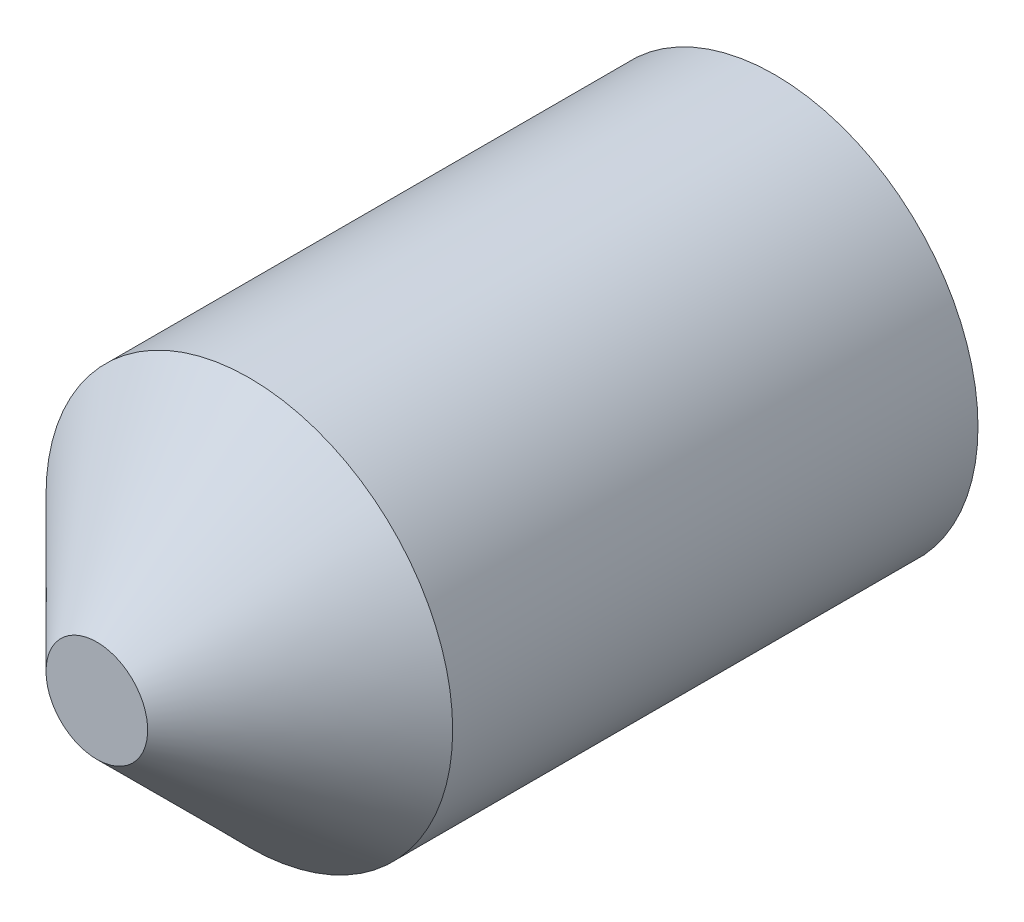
ISO-10303-21;
HEADER;
FILE_DESCRIPTION(('STEP AP214'),'2;1');
FILE_NAME('part.step','',(''),(''),'','','');
FILE_SCHEMA(('AUTOMOTIVE_DESIGN { 1 0 10303 214 1 1 1 1 }'));
ENDSEC;
DATA;
#1=APPLICATION_CONTEXT('core data for automotive mechanical design processes');
#2=APPLICATION_PROTOCOL_DEFINITION('international standard','automotive_design',2000,#1);
#3=PRODUCT_CONTEXT('',#1,'mechanical');
#4=PRODUCT('Part','Part','',(#3));
#5=PRODUCT_RELATED_PRODUCT_CATEGORY('part','',(#4));
#6=PRODUCT_DEFINITION_FORMATION('','',#4);
#7=PRODUCT_DEFINITION_CONTEXT('part definition',#1,'design');
#8=PRODUCT_DEFINITION('design','',#6,#7);
#9=PRODUCT_DEFINITION_SHAPE('','',#8);
#10=(LENGTH_UNIT() NAMED_UNIT(*) SI_UNIT(.MILLI.,.METRE.));
#11=(NAMED_UNIT(*) PLANE_ANGLE_UNIT() SI_UNIT($,.RADIAN.));
#12=(NAMED_UNIT(*) SI_UNIT($,.STERADIAN.) SOLID_ANGLE_UNIT());
#13=UNCERTAINTY_MEASURE_WITH_UNIT(LENGTH_MEASURE(1.E-05),#10,'distance_accuracy_value','');
#14=(GEOMETRIC_REPRESENTATION_CONTEXT(3) GLOBAL_UNCERTAINTY_ASSIGNED_CONTEXT((#13)) GLOBAL_UNIT_ASSIGNED_CONTEXT((#10,
#11,#12)) REPRESENTATION_CONTEXT('',''));
#15=CARTESIAN_POINT('',(0.,0.,0.));
#16=DIRECTION('',(0.,0.,1.));
#17=DIRECTION('',(1.,0.,0.));
#18=AXIS2_PLACEMENT_3D('',#15,#16,#17);
#19=CARTESIAN_POINT('',(0.,0.,10.));
#20=DIRECTION('',(0.,0.,-1.));
#21=DIRECTION('',(-1.,0.,0.));
#22=AXIS2_PLACEMENT_3D('',#19,#20,#21);
#23=CYLINDRICAL_SURFACE('',#22,3.);
#24=CARTESIAN_POINT('',(0.,0.,7.74999999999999));
#25=DIRECTION('',(0.,0.,1.));
#26=DIRECTION('',(1.,0.,0.));
#27=AXIS2_PLACEMENT_3D('',#24,#25,#26);
#28=CIRCLE('',#27,3.);
#29=CARTESIAN_POINT('',(-3.,0.,7.74999999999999));
#30=VERTEX_POINT('',#29);
#31=EDGE_CURVE('E11',#30,#30,#28,.F.);
#32=ORIENTED_EDGE('',*,*,#31,.T.);
#33=EDGE_LOOP('',(#32));
#34=FACE_BOUND('',#33,.T.);
#35=CARTESIAN_POINT('',(0.,0.,0.));
#36=DIRECTION('',(0.,0.,1.));
#37=DIRECTION('',(1.,0.,0.));
#38=AXIS2_PLACEMENT_3D('',#35,#36,#37);
#39=CIRCLE('',#38,3.);
#40=CARTESIAN_POINT('',(3.,0.,0.));
#41=VERTEX_POINT('',#40);
#42=EDGE_CURVE('E135',#41,#41,#39,.T.);
#43=ORIENTED_EDGE('',*,*,#42,.T.);
#44=EDGE_LOOP('',(#43));
#45=FACE_BOUND('',#44,.T.);
#46=ADVANCED_FACE('F32',(#34,#45),#23,.T.);
#47=CARTESIAN_POINT('',(0.,0.,10.));
#48=DIRECTION('',(0.,0.,1.));
#49=DIRECTION('',(1.,0.,0.));
#50=AXIS2_PLACEMENT_3D('',#47,#48,#49);
#51=PLANE('',#50);
#52=CARTESIAN_POINT('',(0.,0.,10.));
#53=DIRECTION('',(0.,0.,1.));
#54=DIRECTION('',(1.,0.,0.));
#55=AXIS2_PLACEMENT_3D('',#52,#53,#54);
#56=CIRCLE('',#55,0.750000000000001);
#57=CARTESIAN_POINT('',(-0.750000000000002,0.,10.));
#58=VERTEX_POINT('',#57);
#59=EDGE_CURVE('E40',#58,#58,#56,.T.);
#60=ORIENTED_EDGE('',*,*,#59,.T.);
#61=EDGE_LOOP('',(#60));
#62=FACE_BOUND('',#61,.T.);
#63=ADVANCED_FACE('F146',(#62),#51,.T.);
#64=CARTESIAN_POINT('',(0.,0.,0.));
#65=DIRECTION('',(0.,0.,1.));
#66=DIRECTION('',(1.,0.,0.));
#67=AXIS2_PLACEMENT_3D('',#64,#65,#66);
#68=PLANE('',#67);
#69=DIRECTION('',(-0.866025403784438,0.5,0.));
#70=VECTOR('',#69,1.);
#71=CARTESIAN_POINT('',(0.,-1.73205080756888,0.));
#72=LINE('',#71,#70);
#73=CARTESIAN_POINT('',(0.,-1.73205080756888,0.));
#74=VERTEX_POINT('',#73);
#75=CARTESIAN_POINT('',(-1.5,-0.866025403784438,0.));
#76=VERTEX_POINT('',#75);
#77=EDGE_CURVE('E101',#74,#76,#72,.T.);
#78=ORIENTED_EDGE('',*,*,#77,.F.);
#79=DIRECTION('',(-0.866025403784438,-0.5,0.));
#80=VECTOR('',#79,1.);
#81=CARTESIAN_POINT('',(1.5,-0.866025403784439,0.));
#82=LINE('',#81,#80);
#83=CARTESIAN_POINT('',(1.5,-0.866025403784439,0.));
#84=VERTEX_POINT('',#83);
#85=EDGE_CURVE('E47',#84,#74,#82,.T.);
#86=ORIENTED_EDGE('',*,*,#85,.F.);
#87=DIRECTION('',(0.,-1.,0.));
#88=VECTOR('',#87,1.);
#89=CARTESIAN_POINT('',(1.5,0.866025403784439,0.));
#90=LINE('',#89,#88);
#91=CARTESIAN_POINT('',(1.5,0.866025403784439,0.));
#92=VERTEX_POINT('',#91);
#93=EDGE_CURVE('E117',#92,#84,#90,.T.);
#94=ORIENTED_EDGE('',*,*,#93,.F.);
#95=DIRECTION('',(0.866025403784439,-0.5,0.));
#96=VECTOR('',#95,1.);
#97=CARTESIAN_POINT('',(0.,1.73205080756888,0.));
#98=LINE('',#97,#96);
#99=CARTESIAN_POINT('',(0.,1.73205080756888,0.));
#100=VERTEX_POINT('',#99);
#101=EDGE_CURVE('E111',#100,#92,#98,.T.);
#102=ORIENTED_EDGE('',*,*,#101,.F.);
#103=DIRECTION('',(0.866025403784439,0.5,0.));
#104=VECTOR('',#103,1.);
#105=CARTESIAN_POINT('',(-1.5,0.86602540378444,0.));
#106=LINE('',#105,#104);
#107=CARTESIAN_POINT('',(-1.5,0.86602540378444,0.));
#108=VERTEX_POINT('',#107);
#109=EDGE_CURVE('E109',#108,#100,#106,.T.);
#110=ORIENTED_EDGE('',*,*,#109,.F.);
#111=DIRECTION('',(0.,1.,0.));
#112=VECTOR('',#111,1.);
#113=CARTESIAN_POINT('',(-1.5,-0.866025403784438,0.));
#114=LINE('',#113,#112);
#115=EDGE_CURVE('E90',#76,#108,#114,.T.);
#116=ORIENTED_EDGE('',*,*,#115,.F.);
#117=EDGE_LOOP('',(#78,#86,#94,#102,#110,#116));
#118=FACE_BOUND('',#117,.T.);
#119=ORIENTED_EDGE('',*,*,#42,.F.);
#120=EDGE_LOOP('',(#119));
#121=FACE_BOUND('',#120,.T.);
#122=ADVANCED_FACE('F105',(#118,#121),#68,.F.);
#123=CARTESIAN_POINT('',(0.,0.,10.));
#124=DIRECTION('',(0.,0.,-1.));
#125=DIRECTION('',(-1.,0.,0.));
#126=AXIS2_PLACEMENT_3D('',#123,#124,#125);
#127=CONICAL_SURFACE('',#126,0.750000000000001,0.785398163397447);
#128=CARTESIAN_POINT('',(-3.,0.,7.74999999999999));
#129=CARTESIAN_POINT('',(-2.9765625,0.,7.77343749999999));
#130=CARTESIAN_POINT('',(-2.953125,0.,7.79687499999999));
#131=CARTESIAN_POINT('',(-2.90625,0.,7.84374999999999));
#132=CARTESIAN_POINT('',(-2.8828125,0.,7.86718749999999));
#133=CARTESIAN_POINT('',(-2.8359375,0.,7.91406249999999));
#134=CARTESIAN_POINT('',(-2.8125,0.,7.93749999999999));
#135=CARTESIAN_POINT('',(-2.765625,0.,7.98437499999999));
#136=CARTESIAN_POINT('',(-2.7421875,0.,8.00781249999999));
#137=CARTESIAN_POINT('',(-2.6953125,0.,8.05468749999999));
#138=CARTESIAN_POINT('',(-2.671875,0.,8.07812499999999));
#139=CARTESIAN_POINT('',(-2.625,0.,8.12499999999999));
#140=CARTESIAN_POINT('',(-2.6015625,0.,8.14843749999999));
#141=CARTESIAN_POINT('',(-2.5546875,0.,8.19531249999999));
#142=CARTESIAN_POINT('',(-2.53125,0.,8.21874999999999));
#143=CARTESIAN_POINT('',(-2.484375,0.,8.26562499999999));
#144=CARTESIAN_POINT('',(-2.4609375,0.,8.28906249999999));
#145=CARTESIAN_POINT('',(-2.4140625,0.,8.3359375));
#146=CARTESIAN_POINT('',(-2.390625,0.,8.35937499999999));
#147=CARTESIAN_POINT('',(-2.34375,0.,8.40624999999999));
#148=CARTESIAN_POINT('',(-2.3203125,0.,8.4296875));
#149=CARTESIAN_POINT('',(-2.2734375,0.,8.4765625));
#150=CARTESIAN_POINT('',(-2.25,0.,8.49999999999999));
#151=CARTESIAN_POINT('',(-2.203125,0.,8.54687499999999));
#152=CARTESIAN_POINT('',(-2.1796875,0.,8.5703125));
#153=CARTESIAN_POINT('',(-2.1328125,0.,8.6171875));
#154=CARTESIAN_POINT('',(-2.109375,0.,8.64062499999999));
#155=CARTESIAN_POINT('',(-2.0625,0.,8.6875));
#156=CARTESIAN_POINT('',(-2.0390625,0.,8.7109375));
#157=CARTESIAN_POINT('',(-1.9921875,0.,8.7578125));
#158=CARTESIAN_POINT('',(-1.96875,0.,8.78125));
#159=CARTESIAN_POINT('',(-1.921875,0.,8.828125));
#160=CARTESIAN_POINT('',(-1.8984375,0.,8.8515625));
#161=CARTESIAN_POINT('',(-1.8515625,0.,8.8984375));
#162=CARTESIAN_POINT('',(-1.828125,0.,8.921875));
#163=CARTESIAN_POINT('',(-1.78125,0.,8.96875));
#164=CARTESIAN_POINT('',(-1.7578125,0.,8.9921875));
#165=CARTESIAN_POINT('',(-1.7109375,0.,9.0390625));
#166=CARTESIAN_POINT('',(-1.6875,0.,9.0625));
#167=CARTESIAN_POINT('',(-1.640625,0.,9.109375));
#168=CARTESIAN_POINT('',(-1.6171875,0.,9.1328125));
#169=CARTESIAN_POINT('',(-1.5703125,0.,9.1796875));
#170=CARTESIAN_POINT('',(-1.546875,0.,9.203125));
#171=CARTESIAN_POINT('',(-1.5,0.,9.25));
#172=CARTESIAN_POINT('',(-1.4765625,0.,9.2734375));
#173=CARTESIAN_POINT('',(-1.4296875,0.,9.3203125));
#174=CARTESIAN_POINT('',(-1.40625,0.,9.34375));
#175=CARTESIAN_POINT('',(-1.359375,0.,9.390625));
#176=CARTESIAN_POINT('',(-1.3359375,0.,9.4140625));
#177=CARTESIAN_POINT('',(-1.2890625,0.,9.4609375));
#178=CARTESIAN_POINT('',(-1.265625,0.,9.484375));
#179=CARTESIAN_POINT('',(-1.21875,0.,9.53125));
#180=CARTESIAN_POINT('',(-1.1953125,0.,9.5546875));
#181=CARTESIAN_POINT('',(-1.1484375,0.,9.6015625));
#182=CARTESIAN_POINT('',(-1.125,0.,9.625));
#183=CARTESIAN_POINT('',(-1.078125,0.,9.671875));
#184=CARTESIAN_POINT('',(-1.0546875,0.,9.6953125));
#185=CARTESIAN_POINT('',(-1.0078125,0.,9.7421875));
#186=CARTESIAN_POINT('',(-0.984375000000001,0.,9.765625));
#187=CARTESIAN_POINT('',(-0.937500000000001,0.,9.8125));
#188=CARTESIAN_POINT('',(-0.914062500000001,0.,9.8359375));
#189=CARTESIAN_POINT('',(-0.867187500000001,0.,9.8828125));
#190=CARTESIAN_POINT('',(-0.843750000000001,0.,9.90625));
#191=CARTESIAN_POINT('',(-0.796875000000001,0.,9.953125));
#192=CARTESIAN_POINT('',(-0.773437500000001,0.,9.9765625));
#193=CARTESIAN_POINT('',(-0.750000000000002,0.,10.));
#194=B_SPLINE_CURVE_WITH_KNOTS('',3,(#128,#129,#130,#131,#132,#133,#134,#135,#136,#137,#138,
#139,#140,#141,#142,#143,#144,#145,#146,#147,#148,#149,#150,#151,#152,#153,#154,#155,#156,#157,
#158,#159,#160,#161,#162,#163,#164,#165,#166,#167,#168,#169,#170,#171,#172,#173,#174,#175,#176,
#177,#178,#179,#180,#181,#182,#183,#184,#185,#186,#187,#188,#189,#190,#191,#192,#193),
.UNSPECIFIED.,.F.,.F.,(4,2,2,2,2,2,2,2,2,2,2,2,2,2,2,2,2,2,2,2,2,2,2,2,2,2,2,2,2,2,2,2,4),(0.,
0.0994368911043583,0.198873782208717,0.298310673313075,0.397747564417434,0.497184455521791,
0.59662134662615,0.696058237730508,0.795495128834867,0.894932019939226,0.994368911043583,
1.09380580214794,1.1932426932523,1.29267958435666,1.39211647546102,1.49155336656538,
1.59099025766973,1.69042714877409,1.78986403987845,1.88930093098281,1.98873782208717,
2.08817471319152,2.18761160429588,2.28704849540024,2.3864853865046,2.48592227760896,
2.58535916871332,2.68479605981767,2.78423295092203,2.88366984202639,2.98310673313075,
3.08254362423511,3.18198051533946),.UNSPECIFIED.);
#195=EDGE_CURVE('BSEAM148',#30,#58,#194,.T.);
#196=ORIENTED_EDGE('',*,*,#31,.F.);
#197=ORIENTED_EDGE('',*,*,#59,.F.);
#198=ORIENTED_EDGE('',*,*,#195,.T.);
#199=ORIENTED_EDGE('',*,*,#195,.F.);
#200=EDGE_LOOP('',(#196,#198,#197,#199));
#201=FACE_BOUND('',#200,.T.);
#202=ADVANCED_FACE('F148',(#201),#127,.T.);
#203=CARTESIAN_POINT('',(1.5,-0.866025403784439,3.));
#204=DIRECTION('',(0.5,-0.866025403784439,0.));
#205=DIRECTION('',(0.866025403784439,0.5,0.));
#206=AXIS2_PLACEMENT_3D('',#203,#204,#205);
#207=PLANE('',#206);
#208=ORIENTED_EDGE('',*,*,#85,.T.);
#209=DIRECTION('',(0.,0.,-1.));
#210=VECTOR('',#209,1.);
#211=CARTESIAN_POINT('',(0.,-1.73205080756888,3.));
#212=LINE('',#211,#210);
#213=CARTESIAN_POINT('',(0.,-1.73205080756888,3.));
#214=VERTEX_POINT('',#213);
#215=EDGE_CURVE('E98',#214,#74,#212,.T.);
#216=ORIENTED_EDGE('',*,*,#215,.F.);
#217=DIRECTION('',(-0.866025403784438,-0.5,0.));
#218=VECTOR('',#217,1.);
#219=CARTESIAN_POINT('',(1.5,-0.866025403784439,3.));
#220=LINE('',#219,#218);
#221=CARTESIAN_POINT('',(1.5,-0.866025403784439,3.));
#222=VERTEX_POINT('',#221);
#223=EDGE_CURVE('E119',#222,#214,#220,.T.);
#224=ORIENTED_EDGE('',*,*,#223,.F.);
#225=DIRECTION('',(0.,0.,-1.));
#226=VECTOR('',#225,1.);
#227=CARTESIAN_POINT('',(1.5,-0.866025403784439,3.));
#228=LINE('',#227,#226);
#229=EDGE_CURVE('E54',#222,#84,#228,.T.);
#230=ORIENTED_EDGE('',*,*,#229,.T.);
#231=EDGE_LOOP('',(#208,#216,#224,#230));
#232=FACE_BOUND('',#231,.T.);
#233=ADVANCED_FACE('F150',(#232),#207,.F.);
#234=CARTESIAN_POINT('',(1.5,0.866025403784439,3.));
#235=DIRECTION('',(1.,0.,0.));
#236=DIRECTION('',(0.,0.,-1.));
#237=AXIS2_PLACEMENT_3D('',#234,#235,#236);
#238=PLANE('',#237);
#239=ORIENTED_EDGE('',*,*,#93,.T.);
#240=ORIENTED_EDGE('',*,*,#229,.F.);
#241=DIRECTION('',(0.,-1.,0.));
#242=VECTOR('',#241,1.);
#243=CARTESIAN_POINT('',(1.5,0.866025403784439,3.));
#244=LINE('',#243,#242);
#245=CARTESIAN_POINT('',(1.5,0.866025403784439,3.));
#246=VERTEX_POINT('',#245);
#247=EDGE_CURVE('E131',#246,#222,#244,.T.);
#248=ORIENTED_EDGE('',*,*,#247,.F.);
#249=DIRECTION('',(0.,0.,-1.));
#250=VECTOR('',#249,1.);
#251=CARTESIAN_POINT('',(1.5,0.866025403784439,3.));
#252=LINE('',#251,#250);
#253=EDGE_CURVE('E136',#246,#92,#252,.T.);
#254=ORIENTED_EDGE('',*,*,#253,.T.);
#255=EDGE_LOOP('',(#239,#240,#248,#254));
#256=FACE_BOUND('',#255,.T.);
#257=ADVANCED_FACE('F157',(#256),#238,.F.);
#258=CARTESIAN_POINT('',(0.,1.73205080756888,3.));
#259=DIRECTION('',(0.5,0.866025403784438,0.));
#260=DIRECTION('',(-0.866025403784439,0.5,0.));
#261=AXIS2_PLACEMENT_3D('',#258,#259,#260);
#262=PLANE('',#261);
#263=ORIENTED_EDGE('',*,*,#101,.T.);
#264=ORIENTED_EDGE('',*,*,#253,.F.);
#265=DIRECTION('',(0.866025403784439,-0.5,0.));
#266=VECTOR('',#265,1.);
#267=CARTESIAN_POINT('',(0.,1.73205080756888,3.));
#268=LINE('',#267,#266);
#269=CARTESIAN_POINT('',(0.,1.73205080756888,3.));
#270=VERTEX_POINT('',#269);
#271=EDGE_CURVE('E128',#270,#246,#268,.T.);
#272=ORIENTED_EDGE('',*,*,#271,.F.);
#273=DIRECTION('',(0.,0.,-1.));
#274=VECTOR('',#273,1.);
#275=CARTESIAN_POINT('',(0.,1.73205080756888,3.));
#276=LINE('',#275,#274);
#277=EDGE_CURVE('E138',#270,#100,#276,.T.);
#278=ORIENTED_EDGE('',*,*,#277,.T.);
#279=EDGE_LOOP('',(#263,#264,#272,#278));
#280=FACE_BOUND('',#279,.T.);
#281=ADVANCED_FACE('F193',(#280),#262,.F.);
#282=CARTESIAN_POINT('',(-1.5,0.86602540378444,3.));
#283=DIRECTION('',(-0.5,0.866025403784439,0.));
#284=DIRECTION('',(-0.866025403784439,-0.5,0.));
#285=AXIS2_PLACEMENT_3D('',#282,#283,#284);
#286=PLANE('',#285);
#287=ORIENTED_EDGE('',*,*,#109,.T.);
#288=ORIENTED_EDGE('',*,*,#277,.F.);
#289=DIRECTION('',(0.866025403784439,0.5,0.));
#290=VECTOR('',#289,1.);
#291=CARTESIAN_POINT('',(-1.5,0.86602540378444,3.));
#292=LINE('',#291,#290);
#293=CARTESIAN_POINT('',(-1.5,0.86602540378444,3.));
#294=VERTEX_POINT('',#293);
#295=EDGE_CURVE('E125',#294,#270,#292,.T.);
#296=ORIENTED_EDGE('',*,*,#295,.F.);
#297=DIRECTION('',(0.,0.,-1.));
#298=VECTOR('',#297,1.);
#299=CARTESIAN_POINT('',(-1.5,0.86602540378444,3.));
#300=LINE('',#299,#298);
#301=EDGE_CURVE('E97',#294,#108,#300,.T.);
#302=ORIENTED_EDGE('',*,*,#301,.T.);
#303=EDGE_LOOP('',(#287,#288,#296,#302));
#304=FACE_BOUND('',#303,.T.);
#305=ADVANCED_FACE('F202',(#304),#286,.F.);
#306=CARTESIAN_POINT('',(-1.5,-0.866025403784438,3.));
#307=DIRECTION('',(-1.,0.,0.));
#308=DIRECTION('',(0.,-1.,0.));
#309=AXIS2_PLACEMENT_3D('',#306,#307,#308);
#310=PLANE('',#309);
#311=ORIENTED_EDGE('',*,*,#115,.T.);
#312=ORIENTED_EDGE('',*,*,#301,.F.);
#313=DIRECTION('',(0.,1.,0.));
#314=VECTOR('',#313,1.);
#315=CARTESIAN_POINT('',(-1.5,-0.866025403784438,3.));
#316=LINE('',#315,#314);
#317=CARTESIAN_POINT('',(-1.5,-0.866025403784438,3.));
#318=VERTEX_POINT('',#317);
#319=EDGE_CURVE('E93',#318,#294,#316,.T.);
#320=ORIENTED_EDGE('',*,*,#319,.F.);
#321=DIRECTION('',(0.,0.,-1.));
#322=VECTOR('',#321,1.);
#323=CARTESIAN_POINT('',(-1.5,-0.866025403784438,3.));
#324=LINE('',#323,#322);
#325=EDGE_CURVE('E86',#318,#76,#324,.T.);
#326=ORIENTED_EDGE('',*,*,#325,.T.);
#327=EDGE_LOOP('',(#311,#312,#320,#326));
#328=FACE_BOUND('',#327,.T.);
#329=ADVANCED_FACE('F88',(#328),#310,.F.);
#330=CARTESIAN_POINT('',(0.,-1.73205080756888,3.));
#331=DIRECTION('',(-0.5,-0.866025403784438,0.));
#332=DIRECTION('',(0.866025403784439,-0.5,0.));
#333=AXIS2_PLACEMENT_3D('',#330,#331,#332);
#334=PLANE('',#333);
#335=ORIENTED_EDGE('',*,*,#77,.T.);
#336=ORIENTED_EDGE('',*,*,#325,.F.);
#337=DIRECTION('',(-0.866025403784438,0.5,0.));
#338=VECTOR('',#337,1.);
#339=CARTESIAN_POINT('',(0.,-1.73205080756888,3.));
#340=LINE('',#339,#338);
#341=EDGE_CURVE('E122',#214,#318,#340,.T.);
#342=ORIENTED_EDGE('',*,*,#341,.F.);
#343=ORIENTED_EDGE('',*,*,#215,.T.);
#344=EDGE_LOOP('',(#335,#336,#342,#343));
#345=FACE_BOUND('',#344,.T.);
#346=ADVANCED_FACE('F102',(#345),#334,.F.);
#347=CARTESIAN_POINT('',(0.,-1.73205080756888,3.));
#348=DIRECTION('',(0.,0.,-1.));
#349=DIRECTION('',(-1.,0.,0.));
#350=AXIS2_PLACEMENT_3D('',#347,#348,#349);
#351=PLANE('',#350);
#352=ORIENTED_EDGE('',*,*,#223,.T.);
#353=ORIENTED_EDGE('',*,*,#341,.T.);
#354=ORIENTED_EDGE('',*,*,#319,.T.);
#355=ORIENTED_EDGE('',*,*,#295,.T.);
#356=ORIENTED_EDGE('',*,*,#271,.T.);
#357=ORIENTED_EDGE('',*,*,#247,.T.);
#358=EDGE_LOOP('',(#352,#353,#354,#355,#356,#357));
#359=FACE_BOUND('',#358,.T.);
#360=ADVANCED_FACE('F229',(#359),#351,.T.);
#361=CLOSED_SHELL('',(#46,#63,#122,#202,#233,#257,#281,#305,#329,#346,#360));
#362=MANIFOLD_SOLID_BREP('B2',#361);
#363=ADVANCED_BREP_SHAPE_REPRESENTATION('',(#18,#362),#14);
#364=SHAPE_DEFINITION_REPRESENTATION(#9,#363);
ENDSEC;
END-ISO-10303-21;
